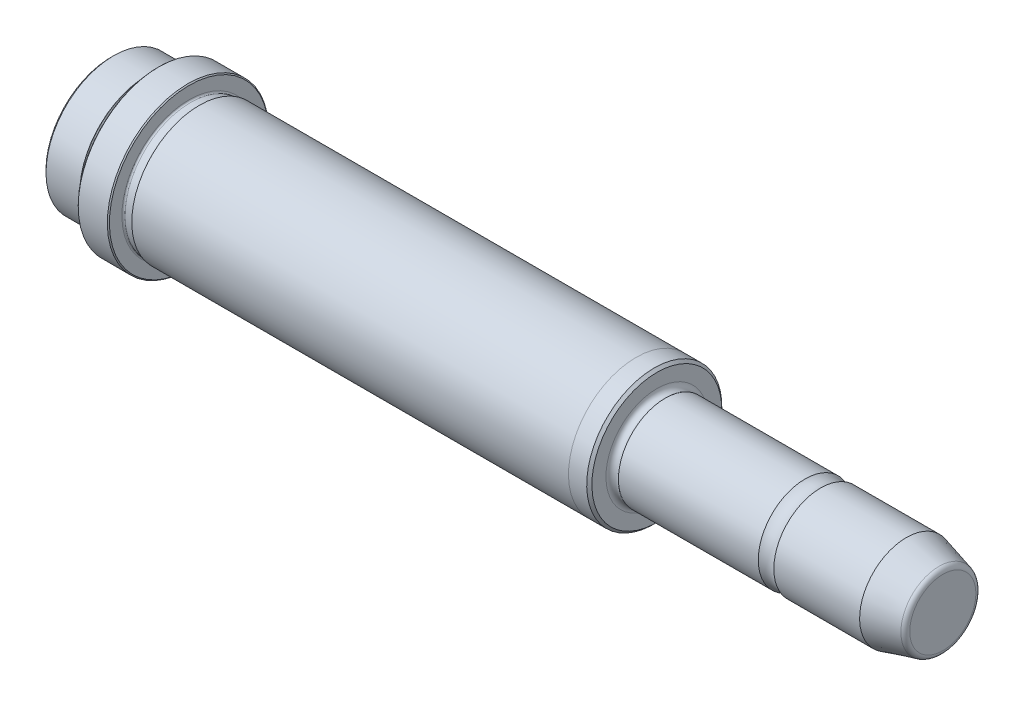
from build123d import *

# Parameters (mm, degrees)
FILLET1_R     = 1
CHAMFER1_SIZE = 0.2
CHAMFER2_SIZE = 0.5


with BuildPart() as part:
    # Sketch1 → Revolve1 (revolve)
    with BuildSketch(Plane.XY):
        with BuildLine():
            Line((55, 7.124355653), (48, 9))
            Line((48, 9), (1.6, 9))
            ThreePointArc((1.6, 9), (0.552786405, 8.905572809), (0, 9.8))
            Line((0, 9.8), (0, 13))
            Line((0, 13), (-4, 13))
            Line((-4, 13), (-88, 13.0001))
            Line((-88, 13.0001), (-88, 12.9))
            ThreePointArc((-88, 12.9), (-88.087867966, 12.687867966), (-88.3, 12.6))
            Line((-88.3, 12.6), (-89.7, 12.6))
            ThreePointArc((-89.7, 12.6), (-89.912132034, 12.687867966), (-90, 12.9))
            Line((-90, 12.9), (-90, 15.5))
            Line((-90, 15.5), (-96, 15.5))
            Line((-96, 15.5), (-96, 12.9))
            ThreePointArc((-96, 12.9), (-96.087867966, 12.687867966), (-96.3, 12.6))
            Line((-96.3, 12.6), (-97.7, 12.6))
            ThreePointArc((-97.7, 12.6), (-97.912132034, 12.687867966), (-98, 12.9))
            Line((-98, 12.9), (-98, 13))
            Line((-98, 13), (-105, 13))
            Line((-105, 13), (-105, 0))
            Line((-105, 0), (55, 0))
            Line((55, 0), (55, 7.124355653))
        make_face()
    revolve(axis=Axis((55, 0, 0), (-1, 0, 0)))

    # Sketch2 → Groove A (revolve, cut)
    with BuildSketch(Plane.XY):
        with BuildLine():
            Line((28.503337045, 9), (31.496662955, 9))
            ThreePointArc((31.496662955, 9), (30, 8.6), (28.503337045, 9))
        make_face()
    revolve(axis=Axis((55, 0, 0), (1, 0, 0)), mode=Mode.SUBTRACT)

    # Fillet1
    fillet1_edges = [part.edges().sort_by_distance(p)[0] for p in [
        (55, -7.124355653, 0),
    ]]
    fillet(fillet1_edges, radius=FILLET1_R)

    # Chamfer1
    chamfer1_edges = [part.edges().sort_by_distance(p)[0] for p in [
        (-90, -15.5, 0),
        (-96, -15.5, 0),
    ]]
    chamfer(chamfer1_edges, length=CHAMFER1_SIZE)

    # Chamfer2
    chamfer2_edges = [part.edges().sort_by_distance(p)[0] for p in [
        (0, -13, 0),
        (-105, -13, 0),
    ]]
    chamfer(chamfer2_edges, length=CHAMFER2_SIZE)


solid = part.part
